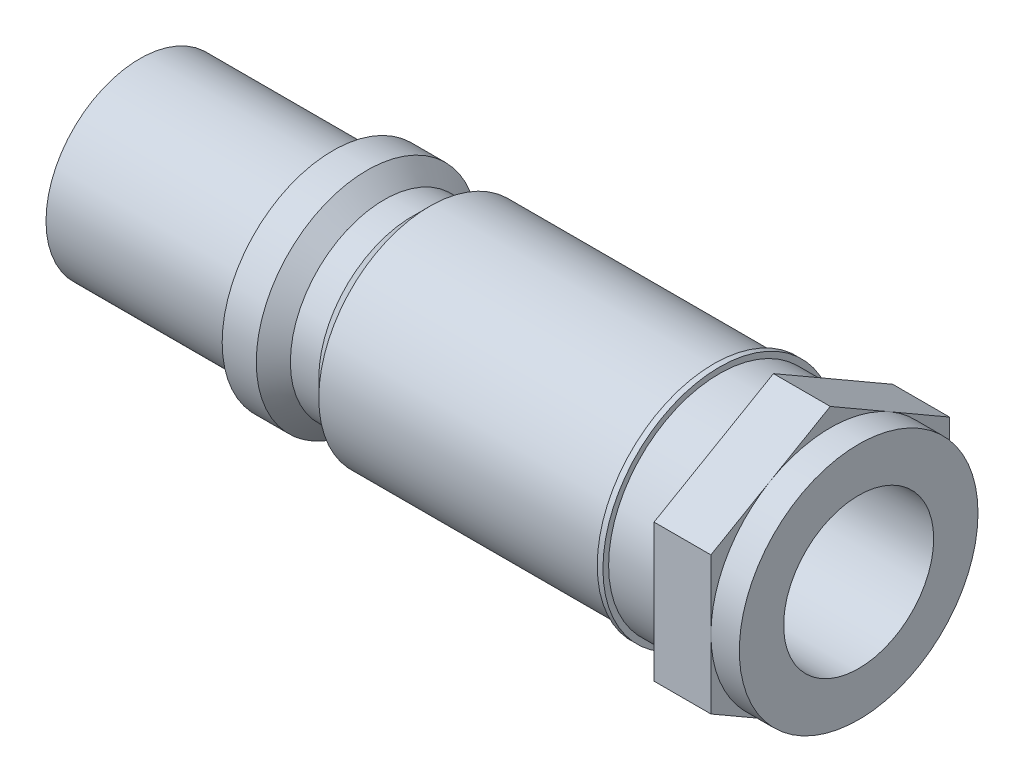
ISO-10303-21;
HEADER;
FILE_DESCRIPTION(('STEP AP214'),'2;1');
FILE_NAME('part.step','',(''),(''),'','','');
FILE_SCHEMA(('AUTOMOTIVE_DESIGN { 1 0 10303 214 1 1 1 1 }'));
ENDSEC;
DATA;
#1=APPLICATION_CONTEXT('core data for automotive mechanical design processes');
#2=APPLICATION_PROTOCOL_DEFINITION('international standard','automotive_design',2000,#1);
#3=PRODUCT_CONTEXT('',#1,'mechanical');
#4=PRODUCT('Part','Part','',(#3));
#5=PRODUCT_RELATED_PRODUCT_CATEGORY('part','',(#4));
#6=PRODUCT_DEFINITION_FORMATION('','',#4);
#7=PRODUCT_DEFINITION_CONTEXT('part definition',#1,'design');
#8=PRODUCT_DEFINITION('design','',#6,#7);
#9=PRODUCT_DEFINITION_SHAPE('','',#8);
#10=(LENGTH_UNIT() NAMED_UNIT(*) SI_UNIT(.MILLI.,.METRE.));
#11=(NAMED_UNIT(*) PLANE_ANGLE_UNIT() SI_UNIT($,.RADIAN.));
#12=(NAMED_UNIT(*) SI_UNIT($,.STERADIAN.) SOLID_ANGLE_UNIT());
#13=UNCERTAINTY_MEASURE_WITH_UNIT(LENGTH_MEASURE(1.E-05),#10,'distance_accuracy_value','');
#14=(GEOMETRIC_REPRESENTATION_CONTEXT(3) GLOBAL_UNCERTAINTY_ASSIGNED_CONTEXT((#13)) GLOBAL_UNIT_ASSIGNED_CONTEXT((#10,
#11,#12)) REPRESENTATION_CONTEXT('',''));
#15=CARTESIAN_POINT('',(0.,0.,0.));
#16=DIRECTION('',(0.,0.,1.));
#17=DIRECTION('',(1.,0.,0.));
#18=AXIS2_PLACEMENT_3D('',#15,#16,#17);
#19=CARTESIAN_POINT('',(121.5,0.,0.));
#20=DIRECTION('',(1.,0.,0.));
#21=DIRECTION('',(0.,0.,-1.));
#22=AXIS2_PLACEMENT_3D('',#19,#20,#21);
#23=PLANE('',#22);
#24=CARTESIAN_POINT('',(121.5,0.,0.));
#25=DIRECTION('',(1.,0.,0.));
#26=DIRECTION('',(0.,0.,-1.));
#27=AXIS2_PLACEMENT_3D('',#24,#25,#26);
#28=CIRCLE('',#27,21.);
#29=CARTESIAN_POINT('',(121.5,0.,-21.));
#30=VERTEX_POINT('',#29);
#31=CARTESIAN_POINT('',(121.5,18.1865334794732,-10.5));
#32=VERTEX_POINT('',#31);
#33=EDGE_CURVE('E44',#30,#32,#28,.T.);
#34=ORIENTED_EDGE('',*,*,#33,.F.);
#35=DIRECTION('',(0.,1.,0.));
#36=VECTOR('',#35,1.);
#37=CARTESIAN_POINT('',(121.5,-12.1243556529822,-21.));
#38=LINE('',#37,#36);
#39=CARTESIAN_POINT('',(121.5,12.1243556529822,-21.));
#40=VERTEX_POINT('',#39);
#41=EDGE_CURVE('E114',#30,#40,#38,.T.);
#42=ORIENTED_EDGE('',*,*,#41,.T.);
#43=DIRECTION('',(0.,0.5,0.866025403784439));
#44=VECTOR('',#43,1.);
#45=CARTESIAN_POINT('',(121.5,12.1243556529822,-21.));
#46=LINE('',#45,#44);
#47=EDGE_CURVE('E125',#40,#32,#46,.T.);
#48=ORIENTED_EDGE('',*,*,#47,.T.);
#49=EDGE_LOOP('',(#34,#42,#48));
#50=FACE_BOUND('',#49,.T.);
#51=ADVANCED_FACE('F33',(#50),#23,.T.);
#52=CARTESIAN_POINT('',(121.5,18.1865334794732,10.5));
#53=VERTEX_POINT('',#52);
#54=EDGE_CURVE('E11',#32,#53,#28,.T.);
#55=ORIENTED_EDGE('',*,*,#54,.F.);
#56=CARTESIAN_POINT('',(121.5,24.2487113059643,0.));
#57=VERTEX_POINT('',#56);
#58=EDGE_CURVE('E139',#32,#57,#46,.T.);
#59=ORIENTED_EDGE('',*,*,#58,.T.);
#60=DIRECTION('',(0.,-0.5,0.866025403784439));
#61=VECTOR('',#60,1.);
#62=CARTESIAN_POINT('',(121.5,24.2487113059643,0.));
#63=LINE('',#62,#61);
#64=EDGE_CURVE('E140',#57,#53,#63,.T.);
#65=ORIENTED_EDGE('',*,*,#64,.T.);
#66=EDGE_LOOP('',(#55,#59,#65));
#67=FACE_BOUND('',#66,.T.);
#68=ADVANCED_FACE('F288',(#67),#23,.T.);
#69=CARTESIAN_POINT('',(121.5,0.,21.));
#70=VERTEX_POINT('',#69);
#71=EDGE_CURVE('E42',#53,#70,#28,.T.);
#72=ORIENTED_EDGE('',*,*,#71,.F.);
#73=CARTESIAN_POINT('',(121.5,12.1243556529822,21.));
#74=VERTEX_POINT('',#73);
#75=EDGE_CURVE('E138',#53,#74,#63,.T.);
#76=ORIENTED_EDGE('',*,*,#75,.T.);
#77=DIRECTION('',(0.,-1.,0.));
#78=VECTOR('',#77,1.);
#79=CARTESIAN_POINT('',(121.5,12.1243556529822,21.));
#80=LINE('',#79,#78);
#81=EDGE_CURVE('E144',#74,#70,#80,.T.);
#82=ORIENTED_EDGE('',*,*,#81,.T.);
#83=EDGE_LOOP('',(#72,#76,#82));
#84=FACE_BOUND('',#83,.T.);
#85=ADVANCED_FACE('F295',(#84),#23,.T.);
#86=CARTESIAN_POINT('',(121.5,-18.1865334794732,10.5));
#87=VERTEX_POINT('',#86);
#88=EDGE_CURVE('E131',#70,#87,#28,.T.);
#89=ORIENTED_EDGE('',*,*,#88,.F.);
#90=CARTESIAN_POINT('',(121.5,-12.1243556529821,21.));
#91=VERTEX_POINT('',#90);
#92=EDGE_CURVE('E143',#70,#91,#80,.T.);
#93=ORIENTED_EDGE('',*,*,#92,.T.);
#94=DIRECTION('',(0.,-0.5,-0.866025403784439));
#95=VECTOR('',#94,1.);
#96=CARTESIAN_POINT('',(121.5,-12.1243556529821,21.));
#97=LINE('',#96,#95);
#98=EDGE_CURVE('E148',#91,#87,#97,.T.);
#99=ORIENTED_EDGE('',*,*,#98,.T.);
#100=EDGE_LOOP('',(#89,#93,#99));
#101=FACE_BOUND('',#100,.T.);
#102=ADVANCED_FACE('F299',(#101),#23,.T.);
#103=CARTESIAN_POINT('',(121.5,-18.1865334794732,-10.5));
#104=VERTEX_POINT('',#103);
#105=EDGE_CURVE('E59',#87,#104,#28,.T.);
#106=ORIENTED_EDGE('',*,*,#105,.F.);
#107=CARTESIAN_POINT('',(121.5,-24.2487113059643,0.));
#108=VERTEX_POINT('',#107);
#109=EDGE_CURVE('E147',#87,#108,#97,.T.);
#110=ORIENTED_EDGE('',*,*,#109,.T.);
#111=DIRECTION('',(0.,0.5,-0.866025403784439));
#112=VECTOR('',#111,1.);
#113=CARTESIAN_POINT('',(121.5,-24.2487113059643,0.));
#114=LINE('',#113,#112);
#115=EDGE_CURVE('E123',#108,#104,#114,.T.);
#116=ORIENTED_EDGE('',*,*,#115,.T.);
#117=EDGE_LOOP('',(#106,#110,#116));
#118=FACE_BOUND('',#117,.T.);
#119=ADVANCED_FACE('F309',(#118),#23,.T.);
#120=CARTESIAN_POINT('',(0.,0.,0.));
#121=DIRECTION('',(1.,0.,0.));
#122=DIRECTION('',(0.,0.,-1.));
#123=AXIS2_PLACEMENT_3D('',#120,#121,#122);
#124=PLANE('',#123);
#125=CARTESIAN_POINT('',(0.,0.,0.));
#126=DIRECTION('',(1.,0.,0.));
#127=DIRECTION('',(0.,0.,-1.));
#128=AXIS2_PLACEMENT_3D('',#125,#126,#127);
#129=CIRCLE('',#128,13.2);
#130=CARTESIAN_POINT('',(0.,0.,-13.2));
#131=VERTEX_POINT('',#130);
#132=EDGE_CURVE('E128',#131,#131,#129,.T.);
#133=ORIENTED_EDGE('',*,*,#132,.T.);
#134=EDGE_LOOP('',(#133));
#135=FACE_BOUND('',#134,.T.);
#136=CARTESIAN_POINT('',(0.,0.,0.));
#137=DIRECTION('',(-1.,0.,0.));
#138=DIRECTION('',(0.,0.,1.));
#139=AXIS2_PLACEMENT_3D('',#136,#137,#138);
#140=CIRCLE('',#139,16.5);
#141=CARTESIAN_POINT('',(0.,0.,16.5));
#142=VERTEX_POINT('',#141);
#143=EDGE_CURVE('E37',#142,#142,#140,.T.);
#144=ORIENTED_EDGE('',*,*,#143,.T.);
#145=EDGE_LOOP('',(#144));
#146=FACE_BOUND('',#145,.T.);
#147=ADVANCED_FACE('F35',(#135,#146),#124,.F.);
#148=CARTESIAN_POINT('',(0.,0.,0.));
#149=DIRECTION('',(-1.,0.,0.));
#150=DIRECTION('',(0.,0.,1.));
#151=AXIS2_PLACEMENT_3D('',#148,#149,#150);
#152=CYLINDRICAL_SURFACE('',#151,16.5);
#153=ORIENTED_EDGE('',*,*,#143,.F.);
#154=EDGE_LOOP('',(#153));
#155=FACE_BOUND('',#154,.T.);
#156=CARTESIAN_POINT('',(34.,0.,0.));
#157=DIRECTION('',(-1.,0.,0.));
#158=DIRECTION('',(0.,0.,1.));
#159=AXIS2_PLACEMENT_3D('',#156,#157,#158);
#160=CIRCLE('',#159,16.5);
#161=CARTESIAN_POINT('',(34.,0.,16.5));
#162=VERTEX_POINT('',#161);
#163=EDGE_CURVE('E133',#162,#162,#160,.T.);
#164=ORIENTED_EDGE('',*,*,#163,.T.);
#165=EDGE_LOOP('',(#164));
#166=FACE_BOUND('',#165,.T.);
#167=ADVANCED_FACE('F212',(#155,#166),#152,.T.);
#168=CARTESIAN_POINT('',(34.,16.5,0.));
#169=DIRECTION('',(1.,0.,0.));
#170=DIRECTION('',(0.,0.,-1.));
#171=AXIS2_PLACEMENT_3D('',#168,#169,#170);
#172=PLANE('',#171);
#173=ORIENTED_EDGE('',*,*,#163,.F.);
#174=EDGE_LOOP('',(#173));
#175=FACE_BOUND('',#174,.T.);
#176=CARTESIAN_POINT('',(34.,0.,0.));
#177=DIRECTION('',(-1.,0.,0.));
#178=DIRECTION('',(0.,0.,1.));
#179=AXIS2_PLACEMENT_3D('',#176,#177,#178);
#180=CIRCLE('',#179,19.5);
#181=CARTESIAN_POINT('',(34.,0.,19.5));
#182=VERTEX_POINT('',#181);
#183=EDGE_CURVE('E207',#182,#182,#180,.T.);
#184=ORIENTED_EDGE('',*,*,#183,.T.);
#185=EDGE_LOOP('',(#184));
#186=FACE_BOUND('',#185,.T.);
#187=ADVANCED_FACE('F214',(#175,#186),#172,.F.);
#188=CARTESIAN_POINT('',(0.,0.,0.));
#189=DIRECTION('',(-1.,0.,0.));
#190=DIRECTION('',(0.,0.,1.));
#191=AXIS2_PLACEMENT_3D('',#188,#189,#190);
#192=CYLINDRICAL_SURFACE('',#191,19.5);
#193=ORIENTED_EDGE('',*,*,#183,.F.);
#194=EDGE_LOOP('',(#193));
#195=FACE_BOUND('',#194,.T.);
#196=CARTESIAN_POINT('',(40.,0.,0.));
#197=DIRECTION('',(-1.,0.,0.));
#198=DIRECTION('',(0.,0.,1.));
#199=AXIS2_PLACEMENT_3D('',#196,#197,#198);
#200=CIRCLE('',#199,19.5);
#201=CARTESIAN_POINT('',(40.,0.,19.5));
#202=VERTEX_POINT('',#201);
#203=EDGE_CURVE('E204',#202,#202,#200,.T.);
#204=ORIENTED_EDGE('',*,*,#203,.T.);
#205=EDGE_LOOP('',(#204));
#206=FACE_BOUND('',#205,.T.);
#207=ADVANCED_FACE('F217',(#195,#206),#192,.T.);
#208=CARTESIAN_POINT('',(43.,0.,0.));
#209=DIRECTION('',(-1.,0.,0.));
#210=DIRECTION('',(0.,0.,1.));
#211=AXIS2_PLACEMENT_3D('',#208,#209,#210);
#212=CONICAL_SURFACE('',#211,16.5,0.78539816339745);
#213=ORIENTED_EDGE('',*,*,#203,.F.);
#214=EDGE_LOOP('',(#213));
#215=FACE_BOUND('',#214,.T.);
#216=CARTESIAN_POINT('',(43.,0.,0.));
#217=DIRECTION('',(-1.,0.,0.));
#218=DIRECTION('',(0.,0.,1.));
#219=AXIS2_PLACEMENT_3D('',#216,#217,#218);
#220=CIRCLE('',#219,16.5);
#221=CARTESIAN_POINT('',(43.,0.,16.5));
#222=VERTEX_POINT('',#221);
#223=EDGE_CURVE('E201',#222,#222,#220,.T.);
#224=ORIENTED_EDGE('',*,*,#223,.T.);
#225=EDGE_LOOP('',(#224));
#226=FACE_BOUND('',#225,.T.);
#227=ADVANCED_FACE('F223',(#215,#226),#212,.T.);
#228=CARTESIAN_POINT('',(0.,0.,0.));
#229=DIRECTION('',(-1.,0.,0.));
#230=DIRECTION('',(0.,0.,1.));
#231=AXIS2_PLACEMENT_3D('',#228,#229,#230);
#232=CYLINDRICAL_SURFACE('',#231,16.5);
#233=ORIENTED_EDGE('',*,*,#223,.F.);
#234=EDGE_LOOP('',(#233));
#235=FACE_BOUND('',#234,.T.);
#236=CARTESIAN_POINT('',(48.,0.,0.));
#237=DIRECTION('',(-1.,0.,0.));
#238=DIRECTION('',(0.,0.,1.));
#239=AXIS2_PLACEMENT_3D('',#236,#237,#238);
#240=CIRCLE('',#239,16.5);
#241=CARTESIAN_POINT('',(48.,0.,16.5));
#242=VERTEX_POINT('',#241);
#243=EDGE_CURVE('E198',#242,#242,#240,.T.);
#244=ORIENTED_EDGE('',*,*,#243,.T.);
#245=EDGE_LOOP('',(#244));
#246=FACE_BOUND('',#245,.T.);
#247=ADVANCED_FACE('F229',(#235,#246),#232,.T.);
#248=CARTESIAN_POINT('',(51.,0.,0.));
#249=DIRECTION('',(1.,0.,0.));
#250=DIRECTION('',(0.,0.,-1.));
#251=AXIS2_PLACEMENT_3D('',#248,#249,#250);
#252=CONICAL_SURFACE('',#251,19.5,0.785398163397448);
#253=ORIENTED_EDGE('',*,*,#243,.F.);
#254=EDGE_LOOP('',(#253));
#255=FACE_BOUND('',#254,.T.);
#256=CARTESIAN_POINT('',(51.,0.,0.));
#257=DIRECTION('',(-1.,0.,0.));
#258=DIRECTION('',(0.,0.,1.));
#259=AXIS2_PLACEMENT_3D('',#256,#257,#258);
#260=CIRCLE('',#259,19.5);
#261=CARTESIAN_POINT('',(51.,0.,19.5));
#262=VERTEX_POINT('',#261);
#263=EDGE_CURVE('E195',#262,#262,#260,.T.);
#264=ORIENTED_EDGE('',*,*,#263,.T.);
#265=EDGE_LOOP('',(#264));
#266=FACE_BOUND('',#265,.T.);
#267=ADVANCED_FACE('F235',(#255,#266),#252,.T.);
#268=CARTESIAN_POINT('',(0.,0.,0.));
#269=DIRECTION('',(-1.,0.,0.));
#270=DIRECTION('',(0.,0.,1.));
#271=AXIS2_PLACEMENT_3D('',#268,#269,#270);
#272=CYLINDRICAL_SURFACE('',#271,19.5);
#273=ORIENTED_EDGE('',*,*,#263,.F.);
#274=EDGE_LOOP('',(#273));
#275=FACE_BOUND('',#274,.T.);
#276=CARTESIAN_POINT('',(101.,0.,0.));
#277=DIRECTION('',(-1.,0.,0.));
#278=DIRECTION('',(0.,0.,1.));
#279=AXIS2_PLACEMENT_3D('',#276,#277,#278);
#280=CIRCLE('',#279,19.5);
#281=CARTESIAN_POINT('',(101.,0.,19.5));
#282=VERTEX_POINT('',#281);
#283=EDGE_CURVE('E192',#282,#282,#280,.T.);
#284=ORIENTED_EDGE('',*,*,#283,.T.);
#285=EDGE_LOOP('',(#284));
#286=FACE_BOUND('',#285,.T.);
#287=ADVANCED_FACE('F241',(#275,#286),#272,.T.);
#288=CARTESIAN_POINT('',(101.,19.5,0.));
#289=DIRECTION('',(1.,0.,0.));
#290=DIRECTION('',(0.,0.,-1.));
#291=AXIS2_PLACEMENT_3D('',#288,#289,#290);
#292=PLANE('',#291);
#293=ORIENTED_EDGE('',*,*,#283,.F.);
#294=EDGE_LOOP('',(#293));
#295=FACE_BOUND('',#294,.T.);
#296=CARTESIAN_POINT('',(101.,0.,0.));
#297=DIRECTION('',(-1.,0.,0.));
#298=DIRECTION('',(0.,0.,1.));
#299=AXIS2_PLACEMENT_3D('',#296,#297,#298);
#300=CIRCLE('',#299,20.5);
#301=CARTESIAN_POINT('',(101.,0.,20.5));
#302=VERTEX_POINT('',#301);
#303=EDGE_CURVE('E189',#302,#302,#300,.T.);
#304=ORIENTED_EDGE('',*,*,#303,.T.);
#305=EDGE_LOOP('',(#304));
#306=FACE_BOUND('',#305,.T.);
#307=ADVANCED_FACE('F247',(#295,#306),#292,.F.);
#308=CARTESIAN_POINT('',(0.,0.,0.));
#309=DIRECTION('',(-1.,0.,0.));
#310=DIRECTION('',(0.,0.,1.));
#311=AXIS2_PLACEMENT_3D('',#308,#309,#310);
#312=CYLINDRICAL_SURFACE('',#311,20.5);
#313=ORIENTED_EDGE('',*,*,#303,.F.);
#314=EDGE_LOOP('',(#313));
#315=FACE_BOUND('',#314,.T.);
#316=CARTESIAN_POINT('',(102.,0.,0.));
#317=DIRECTION('',(-1.,0.,0.));
#318=DIRECTION('',(0.,0.,1.));
#319=AXIS2_PLACEMENT_3D('',#316,#317,#318);
#320=CIRCLE('',#319,20.5);
#321=CARTESIAN_POINT('',(102.,0.,20.5));
#322=VERTEX_POINT('',#321);
#323=EDGE_CURVE('E186',#322,#322,#320,.T.);
#324=ORIENTED_EDGE('',*,*,#323,.T.);
#325=EDGE_LOOP('',(#324));
#326=FACE_BOUND('',#325,.T.);
#327=ADVANCED_FACE('F253',(#315,#326),#312,.T.);
#328=CARTESIAN_POINT('',(102.,20.5,0.));
#329=DIRECTION('',(-1.,0.,0.));
#330=DIRECTION('',(0.,0.,1.));
#331=AXIS2_PLACEMENT_3D('',#328,#329,#330);
#332=PLANE('',#331);
#333=ORIENTED_EDGE('',*,*,#323,.F.);
#334=EDGE_LOOP('',(#333));
#335=FACE_BOUND('',#334,.T.);
#336=CARTESIAN_POINT('',(102.,0.,0.));
#337=DIRECTION('',(-1.,0.,0.));
#338=DIRECTION('',(0.,0.,1.));
#339=AXIS2_PLACEMENT_3D('',#336,#337,#338);
#340=CIRCLE('',#339,19.5);
#341=CARTESIAN_POINT('',(102.,0.,19.5));
#342=VERTEX_POINT('',#341);
#343=EDGE_CURVE('E183',#342,#342,#340,.T.);
#344=ORIENTED_EDGE('',*,*,#343,.T.);
#345=EDGE_LOOP('',(#344));
#346=FACE_BOUND('',#345,.T.);
#347=ADVANCED_FACE('F259',(#335,#346),#332,.F.);
#348=CARTESIAN_POINT('',(0.,0.,0.));
#349=DIRECTION('',(-1.,0.,0.));
#350=DIRECTION('',(0.,0.,1.));
#351=AXIS2_PLACEMENT_3D('',#348,#349,#350);
#352=CYLINDRICAL_SURFACE('',#351,19.5);
#353=ORIENTED_EDGE('',*,*,#343,.F.);
#354=EDGE_LOOP('',(#353));
#355=FACE_BOUND('',#354,.T.);
#356=CARTESIAN_POINT('',(111.5,0.,0.));
#357=DIRECTION('',(-1.,0.,0.));
#358=DIRECTION('',(0.,0.,1.));
#359=AXIS2_PLACEMENT_3D('',#356,#357,#358);
#360=CIRCLE('',#359,19.5);
#361=CARTESIAN_POINT('',(111.5,0.,19.5));
#362=VERTEX_POINT('',#361);
#363=EDGE_CURVE('E180',#362,#362,#360,.T.);
#364=ORIENTED_EDGE('',*,*,#363,.T.);
#365=EDGE_LOOP('',(#364));
#366=FACE_BOUND('',#365,.T.);
#367=ADVANCED_FACE('F265',(#355,#366),#352,.T.);
#368=CARTESIAN_POINT('',(121.5,12.1243556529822,-21.));
#369=DIRECTION('',(0.,-0.866025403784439,0.5));
#370=DIRECTION('',(0.,-0.5,-0.866025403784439));
#371=AXIS2_PLACEMENT_3D('',#368,#369,#370);
#372=PLANE('',#371);
#373=DIRECTION('',(0.,0.5,0.866025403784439));
#374=VECTOR('',#373,1.);
#375=CARTESIAN_POINT('',(111.5,12.1243556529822,-21.));
#376=LINE('',#375,#374);
#377=CARTESIAN_POINT('',(111.5,12.1243556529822,-21.));
#378=VERTEX_POINT('',#377);
#379=CARTESIAN_POINT('',(111.5,24.2487113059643,0.));
#380=VERTEX_POINT('',#379);
#381=EDGE_CURVE('E152',#378,#380,#376,.T.);
#382=ORIENTED_EDGE('',*,*,#381,.T.);
#383=DIRECTION('',(-1.,0.,0.));
#384=VECTOR('',#383,1.);
#385=CARTESIAN_POINT('',(121.5,24.2487113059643,0.));
#386=LINE('',#385,#384);
#387=EDGE_CURVE('E177',#57,#380,#386,.T.);
#388=ORIENTED_EDGE('',*,*,#387,.F.);
#389=ORIENTED_EDGE('',*,*,#58,.F.);
#390=ORIENTED_EDGE('',*,*,#47,.F.);
#391=DIRECTION('',(-1.,0.,0.));
#392=VECTOR('',#391,1.);
#393=CARTESIAN_POINT('',(121.5,12.1243556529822,-21.));
#394=LINE('',#393,#392);
#395=EDGE_CURVE('E113',#40,#378,#394,.T.);
#396=ORIENTED_EDGE('',*,*,#395,.T.);
#397=EDGE_LOOP('',(#382,#388,#389,#390,#396));
#398=FACE_BOUND('',#397,.T.);
#399=ADVANCED_FACE('F271',(#398),#372,.F.);
#400=CARTESIAN_POINT('',(121.5,24.2487113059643,0.));
#401=DIRECTION('',(0.,-0.866025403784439,-0.5));
#402=DIRECTION('',(0.,0.5,-0.866025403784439));
#403=AXIS2_PLACEMENT_3D('',#400,#401,#402);
#404=PLANE('',#403);
#405=DIRECTION('',(0.,-0.5,0.866025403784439));
#406=VECTOR('',#405,1.);
#407=CARTESIAN_POINT('',(111.5,24.2487113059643,0.));
#408=LINE('',#407,#406);
#409=CARTESIAN_POINT('',(111.5,12.1243556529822,21.));
#410=VERTEX_POINT('',#409);
#411=EDGE_CURVE('E155',#380,#410,#408,.T.);
#412=ORIENTED_EDGE('',*,*,#411,.T.);
#413=DIRECTION('',(-1.,0.,0.));
#414=VECTOR('',#413,1.);
#415=CARTESIAN_POINT('',(121.5,12.1243556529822,21.));
#416=LINE('',#415,#414);
#417=EDGE_CURVE('E174',#74,#410,#416,.T.);
#418=ORIENTED_EDGE('',*,*,#417,.F.);
#419=ORIENTED_EDGE('',*,*,#75,.F.);
#420=ORIENTED_EDGE('',*,*,#64,.F.);
#421=ORIENTED_EDGE('',*,*,#387,.T.);
#422=EDGE_LOOP('',(#412,#418,#419,#420,#421));
#423=FACE_BOUND('',#422,.T.);
#424=ADVANCED_FACE('F291',(#423),#404,.F.);
#425=CARTESIAN_POINT('',(121.5,12.1243556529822,21.));
#426=DIRECTION('',(0.,0.,-1.));
#427=DIRECTION('',(-1.,0.,0.));
#428=AXIS2_PLACEMENT_3D('',#425,#426,#427);
#429=PLANE('',#428);
#430=DIRECTION('',(0.,-1.,0.));
#431=VECTOR('',#430,1.);
#432=CARTESIAN_POINT('',(111.5,12.1243556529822,21.));
#433=LINE('',#432,#431);
#434=CARTESIAN_POINT('',(111.5,-12.1243556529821,21.));
#435=VERTEX_POINT('',#434);
#436=EDGE_CURVE('E157',#410,#435,#433,.T.);
#437=ORIENTED_EDGE('',*,*,#436,.T.);
#438=DIRECTION('',(-1.,0.,0.));
#439=VECTOR('',#438,1.);
#440=CARTESIAN_POINT('',(121.5,-12.1243556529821,21.));
#441=LINE('',#440,#439);
#442=EDGE_CURVE('E171',#91,#435,#441,.T.);
#443=ORIENTED_EDGE('',*,*,#442,.F.);
#444=ORIENTED_EDGE('',*,*,#92,.F.);
#445=ORIENTED_EDGE('',*,*,#81,.F.);
#446=ORIENTED_EDGE('',*,*,#417,.T.);
#447=EDGE_LOOP('',(#437,#443,#444,#445,#446));
#448=FACE_BOUND('',#447,.T.);
#449=ADVANCED_FACE('F303',(#448),#429,.F.);
#450=CARTESIAN_POINT('',(121.5,-12.1243556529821,21.));
#451=DIRECTION('',(0.,0.866025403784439,-0.5));
#452=DIRECTION('',(0.,0.5,0.866025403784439));
#453=AXIS2_PLACEMENT_3D('',#450,#451,#452);
#454=PLANE('',#453);
#455=DIRECTION('',(0.,-0.5,-0.866025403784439));
#456=VECTOR('',#455,1.);
#457=CARTESIAN_POINT('',(111.5,-12.1243556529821,21.));
#458=LINE('',#457,#456);
#459=CARTESIAN_POINT('',(111.5,-24.2487113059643,0.));
#460=VERTEX_POINT('',#459);
#461=EDGE_CURVE('E159',#435,#460,#458,.T.);
#462=ORIENTED_EDGE('',*,*,#461,.T.);
#463=DIRECTION('',(-1.,0.,0.));
#464=VECTOR('',#463,1.);
#465=CARTESIAN_POINT('',(121.5,-24.2487113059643,0.));
#466=LINE('',#465,#464);
#467=EDGE_CURVE('E168',#108,#460,#466,.T.);
#468=ORIENTED_EDGE('',*,*,#467,.F.);
#469=ORIENTED_EDGE('',*,*,#109,.F.);
#470=ORIENTED_EDGE('',*,*,#98,.F.);
#471=ORIENTED_EDGE('',*,*,#442,.T.);
#472=EDGE_LOOP('',(#462,#468,#469,#470,#471));
#473=FACE_BOUND('',#472,.T.);
#474=ADVANCED_FACE('F306',(#473),#454,.F.);
#475=CARTESIAN_POINT('',(121.5,-24.2487113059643,0.));
#476=DIRECTION('',(0.,0.866025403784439,0.5));
#477=DIRECTION('',(0.,-0.5,0.866025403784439));
#478=AXIS2_PLACEMENT_3D('',#475,#476,#477);
#479=PLANE('',#478);
#480=DIRECTION('',(0.,0.5,-0.866025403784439));
#481=VECTOR('',#480,1.);
#482=CARTESIAN_POINT('',(111.5,-24.2487113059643,0.));
#483=LINE('',#482,#481);
#484=CARTESIAN_POINT('',(111.5,-12.1243556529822,-21.));
#485=VERTEX_POINT('',#484);
#486=EDGE_CURVE('E161',#460,#485,#483,.T.);
#487=ORIENTED_EDGE('',*,*,#486,.T.);
#488=DIRECTION('',(-1.,0.,0.));
#489=VECTOR('',#488,1.);
#490=CARTESIAN_POINT('',(121.5,-12.1243556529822,-21.));
#491=LINE('',#490,#489);
#492=CARTESIAN_POINT('',(121.5,-12.1243556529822,-21.));
#493=VERTEX_POINT('',#492);
#494=EDGE_CURVE('E166',#493,#485,#491,.T.);
#495=ORIENTED_EDGE('',*,*,#494,.F.);
#496=EDGE_CURVE('E109',#104,#493,#114,.T.);
#497=ORIENTED_EDGE('',*,*,#496,.F.);
#498=ORIENTED_EDGE('',*,*,#115,.F.);
#499=ORIENTED_EDGE('',*,*,#467,.T.);
#500=EDGE_LOOP('',(#487,#495,#497,#498,#499));
#501=FACE_BOUND('',#500,.T.);
#502=ADVANCED_FACE('F311',(#501),#479,.F.);
#503=CARTESIAN_POINT('',(121.5,-12.1243556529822,-21.));
#504=DIRECTION('',(0.,0.,1.));
#505=DIRECTION('',(0.,-1.,0.));
#506=AXIS2_PLACEMENT_3D('',#503,#504,#505);
#507=PLANE('',#506);
#508=DIRECTION('',(0.,1.,0.));
#509=VECTOR('',#508,1.);
#510=CARTESIAN_POINT('',(111.5,-12.1243556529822,-21.));
#511=LINE('',#510,#509);
#512=EDGE_CURVE('E163',#485,#378,#511,.T.);
#513=ORIENTED_EDGE('',*,*,#512,.T.);
#514=ORIENTED_EDGE('',*,*,#395,.F.);
#515=ORIENTED_EDGE('',*,*,#41,.F.);
#516=EDGE_CURVE('E106',#493,#30,#38,.T.);
#517=ORIENTED_EDGE('',*,*,#516,.F.);
#518=ORIENTED_EDGE('',*,*,#494,.T.);
#519=EDGE_LOOP('',(#513,#514,#515,#517,#518));
#520=FACE_BOUND('',#519,.T.);
#521=ADVANCED_FACE('F118',(#520),#507,.F.);
#522=EDGE_CURVE('E51',#104,#30,#28,.T.);
#523=ORIENTED_EDGE('',*,*,#522,.F.);
#524=ORIENTED_EDGE('',*,*,#496,.T.);
#525=ORIENTED_EDGE('',*,*,#516,.T.);
#526=EDGE_LOOP('',(#523,#524,#525));
#527=FACE_BOUND('',#526,.T.);
#528=ADVANCED_FACE('F108',(#527),#23,.T.);
#529=CARTESIAN_POINT('',(111.5,0.,0.));
#530=DIRECTION('',(1.,0.,0.));
#531=DIRECTION('',(0.,0.,-1.));
#532=AXIS2_PLACEMENT_3D('',#529,#530,#531);
#533=PLANE('',#532);
#534=ORIENTED_EDGE('',*,*,#363,.F.);
#535=EDGE_LOOP('',(#534));
#536=FACE_BOUND('',#535,.T.);
#537=ORIENTED_EDGE('',*,*,#381,.F.);
#538=ORIENTED_EDGE('',*,*,#512,.F.);
#539=ORIENTED_EDGE('',*,*,#486,.F.);
#540=ORIENTED_EDGE('',*,*,#461,.F.);
#541=ORIENTED_EDGE('',*,*,#436,.F.);
#542=ORIENTED_EDGE('',*,*,#411,.F.);
#543=EDGE_LOOP('',(#537,#538,#539,#540,#541,#542));
#544=FACE_BOUND('',#543,.T.);
#545=ADVANCED_FACE('F275',(#536,#544),#533,.F.);
#546=CARTESIAN_POINT('',(126.5,0.,0.));
#547=DIRECTION('',(-1.,0.,0.));
#548=DIRECTION('',(0.,0.,1.));
#549=AXIS2_PLACEMENT_3D('',#546,#547,#548);
#550=CYLINDRICAL_SURFACE('',#549,21.);
#551=CARTESIAN_POINT('',(126.5,0.,0.));
#552=DIRECTION('',(1.,0.,0.));
#553=DIRECTION('',(0.,0.,-1.));
#554=AXIS2_PLACEMENT_3D('',#551,#552,#553);
#555=CIRCLE('',#554,21.);
#556=CARTESIAN_POINT('',(126.5,0.,-21.));
#557=VERTEX_POINT('',#556);
#558=EDGE_CURVE('E127',#557,#557,#555,.T.);
#559=ORIENTED_EDGE('',*,*,#558,.F.);
#560=EDGE_LOOP('',(#559));
#561=FACE_BOUND('',#560,.T.);
#562=ORIENTED_EDGE('',*,*,#33,.T.);
#563=ORIENTED_EDGE('',*,*,#54,.T.);
#564=ORIENTED_EDGE('',*,*,#71,.T.);
#565=ORIENTED_EDGE('',*,*,#88,.T.);
#566=ORIENTED_EDGE('',*,*,#105,.T.);
#567=ORIENTED_EDGE('',*,*,#522,.T.);
#568=EDGE_LOOP('',(#562,#563,#564,#565,#566,#567));
#569=FACE_BOUND('',#568,.T.);
#570=ADVANCED_FACE('F129',(#561,#569),#550,.T.);
#571=CARTESIAN_POINT('',(126.5,0.,0.));
#572=DIRECTION('',(1.,0.,0.));
#573=DIRECTION('',(0.,0.,-1.));
#574=AXIS2_PLACEMENT_3D('',#571,#572,#573);
#575=PLANE('',#574);
#576=CARTESIAN_POINT('',(126.5,0.,0.));
#577=DIRECTION('',(1.,0.,0.));
#578=DIRECTION('',(0.,0.,-1.));
#579=AXIS2_PLACEMENT_3D('',#576,#577,#578);
#580=CIRCLE('',#579,13.2);
#581=CARTESIAN_POINT('',(126.5,0.,-13.2));
#582=VERTEX_POINT('',#581);
#583=EDGE_CURVE('E470',#582,#582,#580,.T.);
#584=ORIENTED_EDGE('',*,*,#583,.F.);
#585=EDGE_LOOP('',(#584));
#586=FACE_BOUND('',#585,.T.);
#587=ORIENTED_EDGE('',*,*,#558,.T.);
#588=EDGE_LOOP('',(#587));
#589=FACE_BOUND('',#588,.T.);
#590=ADVANCED_FACE('F441',(#586,#589),#575,.T.);
#591=CARTESIAN_POINT('',(0.,0.,0.));
#592=DIRECTION('',(1.,0.,0.));
#593=DIRECTION('',(0.,0.,-1.));
#594=AXIS2_PLACEMENT_3D('',#591,#592,#593);
#595=CYLINDRICAL_SURFACE('',#594,13.2);
#596=ORIENTED_EDGE('',*,*,#132,.F.);
#597=EDGE_LOOP('',(#596));
#598=FACE_BOUND('',#597,.T.);
#599=ORIENTED_EDGE('',*,*,#583,.T.);
#600=EDGE_LOOP('',(#599));
#601=FACE_BOUND('',#600,.T.);
#602=ADVANCED_FACE('F446',(#598,#601),#595,.F.);
#603=CLOSED_SHELL('',(#51,#68,#85,#102,#119,#147,#167,#187,#207,#227,#247,#267,#287,#307,#327,
#347,#367,#399,#424,#449,#474,#502,#521,#528,#545,#570,#590,#602));
#604=MANIFOLD_SOLID_BREP('B2',#603);
#605=ADVANCED_BREP_SHAPE_REPRESENTATION('',(#18,#604),#14);
#606=SHAPE_DEFINITION_REPRESENTATION(#9,#605);
ENDSEC;
END-ISO-10303-21;
